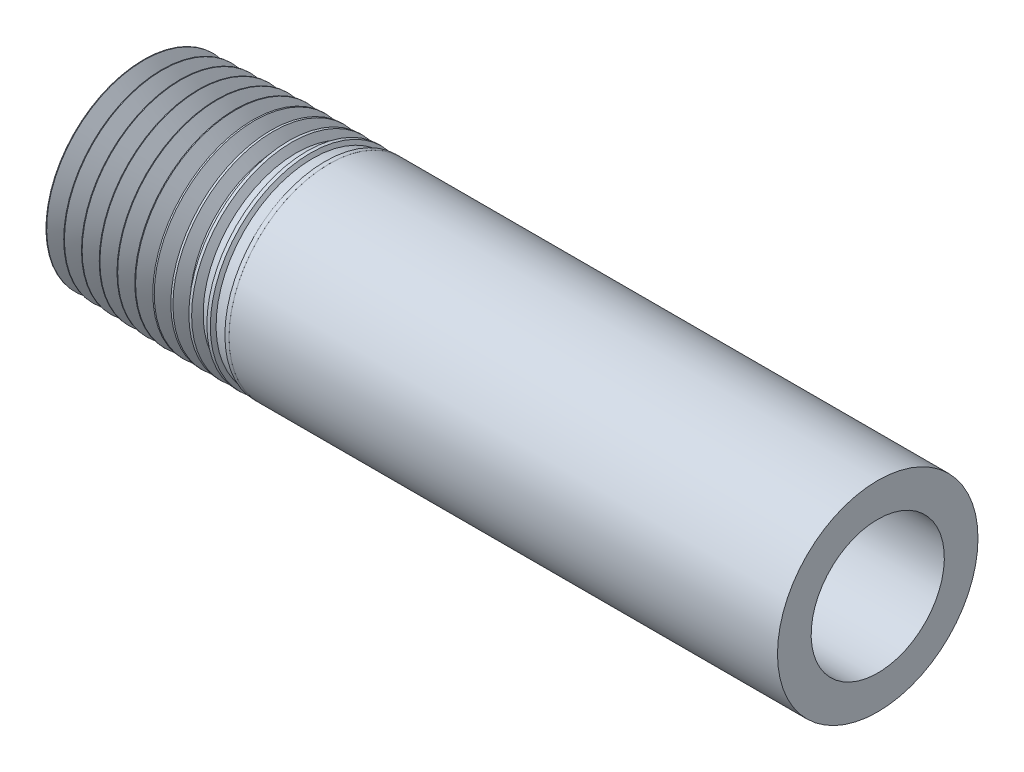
ISO-10303-21;
HEADER;
FILE_DESCRIPTION(('STEP AP214'),'2;1');
FILE_NAME('part.step','',(''),(''),'','','');
FILE_SCHEMA(('AUTOMOTIVE_DESIGN { 1 0 10303 214 1 1 1 1 }'));
ENDSEC;
DATA;
#1=APPLICATION_CONTEXT('core data for automotive mechanical design processes');
#2=APPLICATION_PROTOCOL_DEFINITION('international standard','automotive_design',2000,#1);
#3=PRODUCT_CONTEXT('',#1,'mechanical');
#4=PRODUCT('Part','Part','',(#3));
#5=PRODUCT_RELATED_PRODUCT_CATEGORY('part','',(#4));
#6=PRODUCT_DEFINITION_FORMATION('','',#4);
#7=PRODUCT_DEFINITION_CONTEXT('part definition',#1,'design');
#8=PRODUCT_DEFINITION('design','',#6,#7);
#9=PRODUCT_DEFINITION_SHAPE('','',#8);
#10=(LENGTH_UNIT() NAMED_UNIT(*) SI_UNIT(.MILLI.,.METRE.));
#11=(NAMED_UNIT(*) PLANE_ANGLE_UNIT() SI_UNIT($,.RADIAN.));
#12=(NAMED_UNIT(*) SI_UNIT($,.STERADIAN.) SOLID_ANGLE_UNIT());
#13=UNCERTAINTY_MEASURE_WITH_UNIT(LENGTH_MEASURE(1.E-05),#10,'distance_accuracy_value','');
#14=(GEOMETRIC_REPRESENTATION_CONTEXT(3) GLOBAL_UNCERTAINTY_ASSIGNED_CONTEXT((#13)) GLOBAL_UNIT_ASSIGNED_CONTEXT((#10,
#11,#12)) REPRESENTATION_CONTEXT('',''));
#15=CARTESIAN_POINT('',(0.,0.,0.));
#16=DIRECTION('',(0.,0.,1.));
#17=DIRECTION('',(1.,0.,0.));
#18=AXIS2_PLACEMENT_3D('',#15,#16,#17);
#19=CARTESIAN_POINT('',(5.12914754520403,0.,0.));
#20=DIRECTION('',(1.,0.,0.));
#21=DIRECTION('',(0.,1.,0.));
#22=AXIS2_PLACEMENT_3D('',#19,#20,#21);
#23=CONICAL_SURFACE('',#22,5.14687067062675,1.0784389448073);
#24=CARTESIAN_POINT('',(5.12733944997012,0.,0.));
#25=DIRECTION('',(1.,0.,0.));
#26=DIRECTION('',(0.,1.,0.));
#27=AXIS2_PLACEMENT_3D('',#24,#25,#26);
#28=CIRCLE('',#27,5.1435);
#29=CARTESIAN_POINT('',(5.12733944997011,5.1435,0.));
#30=VERTEX_POINT('',#29);
#31=EDGE_CURVE('E51',#30,#30,#28,.T.);
#32=ORIENTED_EDGE('',*,*,#31,.F.);
#33=EDGE_LOOP('',(#32));
#34=FACE_BOUND('',#33,.T.);
#35=CARTESIAN_POINT('',(4.71836175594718,0.,0.));
#36=DIRECTION('',(1.,0.,0.));
#37=DIRECTION('',(0.,1.,0.));
#38=AXIS2_PLACEMENT_3D('',#35,#36,#37);
#39=CIRCLE('',#38,4.38107937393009);
#40=CARTESIAN_POINT('',(4.71836175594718,4.38107937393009,0.));
#41=VERTEX_POINT('',#40);
#42=EDGE_CURVE('E146',#41,#41,#39,.T.);
#43=ORIENTED_EDGE('',*,*,#42,.T.);
#44=EDGE_LOOP('',(#43));
#45=FACE_BOUND('',#44,.T.);
#46=ADVANCED_FACE('F31',(#34,#45),#23,.T.);
#47=CARTESIAN_POINT('',(4.71836175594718,0.,0.));
#48=DIRECTION('',(1.,0.,0.));
#49=DIRECTION('',(0.,1.,0.));
#50=AXIS2_PLACEMENT_3D('',#47,#48,#49);
#51=CONICAL_SURFACE('',#50,4.38107937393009,0.0312413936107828);
#52=CARTESIAN_POINT('',(4.68251471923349,0.,0.));
#53=DIRECTION('',(1.,0.,0.));
#54=DIRECTION('',(0.,1.,0.));
#55=AXIS2_PLACEMENT_3D('',#52,#53,#54);
#56=CIRCLE('',#55,4.37995909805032);
#57=CARTESIAN_POINT('',(4.68251471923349,4.37995909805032,0.));
#58=VERTEX_POINT('',#57);
#59=EDGE_CURVE('E143',#58,#58,#56,.T.);
#60=ORIENTED_EDGE('',*,*,#59,.T.);
#61=EDGE_LOOP('',(#60));
#62=FACE_BOUND('',#61,.T.);
#63=ORIENTED_EDGE('',*,*,#42,.F.);
#64=EDGE_LOOP('',(#63));
#65=FACE_BOUND('',#64,.T.);
#66=ADVANCED_FACE('F167',(#62,#65),#51,.T.);
#67=CARTESIAN_POINT('',(4.68251471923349,0.,0.));
#68=DIRECTION('',(-1.,0.,0.));
#69=DIRECTION('',(0.,-1.,0.));
#70=AXIS2_PLACEMENT_3D('',#67,#68,#69);
#71=CONICAL_SURFACE('',#70,4.37995909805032,1.01595615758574);
#72=CARTESIAN_POINT('',(4.22471289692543,0.,0.));
#73=DIRECTION('',(1.,0.,0.));
#74=DIRECTION('',(0.,1.,0.));
#75=AXIS2_PLACEMENT_3D('',#72,#73,#74);
#76=CIRCLE('',#75,5.11860567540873);
#77=CARTESIAN_POINT('',(4.22471289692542,5.11860567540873,0.));
#78=VERTEX_POINT('',#77);
#79=EDGE_CURVE('E140',#78,#78,#76,.T.);
#80=ORIENTED_EDGE('',*,*,#79,.T.);
#81=EDGE_LOOP('',(#80));
#82=FACE_BOUND('',#81,.T.);
#83=ORIENTED_EDGE('',*,*,#59,.F.);
#84=EDGE_LOOP('',(#83));
#85=FACE_BOUND('',#84,.T.);
#86=ADVANCED_FACE('F172',(#82,#85),#71,.T.);
#87=CARTESIAN_POINT('',(4.22471289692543,0.,0.));
#88=DIRECTION('',(1.,0.,0.));
#89=DIRECTION('',(0.,1.,0.));
#90=AXIS2_PLACEMENT_3D('',#87,#88,#89);
#91=CONICAL_SURFACE('',#90,5.11860567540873,0.0312413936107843);
#92=CARTESIAN_POINT('',(4.18886586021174,0.,0.));
#93=DIRECTION('',(1.,0.,0.));
#94=DIRECTION('',(0.,1.,0.));
#95=AXIS2_PLACEMENT_3D('',#92,#93,#94);
#96=CIRCLE('',#95,5.11748539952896);
#97=CARTESIAN_POINT('',(4.18886586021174,5.11748539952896,0.));
#98=VERTEX_POINT('',#97);
#99=EDGE_CURVE('E137',#98,#98,#96,.T.);
#100=ORIENTED_EDGE('',*,*,#99,.T.);
#101=EDGE_LOOP('',(#100));
#102=FACE_BOUND('',#101,.T.);
#103=ORIENTED_EDGE('',*,*,#79,.F.);
#104=EDGE_LOOP('',(#103));
#105=FACE_BOUND('',#104,.T.);
#106=ADVANCED_FACE('F178',(#102,#105),#91,.T.);
#107=CARTESIAN_POINT('',(4.18886586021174,0.,0.));
#108=DIRECTION('',(1.,0.,0.));
#109=DIRECTION('',(0.,1.,0.));
#110=AXIS2_PLACEMENT_3D('',#107,#108,#109);
#111=CONICAL_SURFACE('',#110,5.11748539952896,1.07843894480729);
#112=CARTESIAN_POINT('',(3.77808007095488,0.,0.));
#113=DIRECTION('',(1.,0.,0.));
#114=DIRECTION('',(0.,1.,0.));
#115=AXIS2_PLACEMENT_3D('',#112,#113,#114);
#116=CIRCLE('',#115,4.3516941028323);
#117=CARTESIAN_POINT('',(3.77808007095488,4.3516941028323,0.));
#118=VERTEX_POINT('',#117);
#119=EDGE_CURVE('E134',#118,#118,#116,.T.);
#120=ORIENTED_EDGE('',*,*,#119,.T.);
#121=EDGE_LOOP('',(#120));
#122=FACE_BOUND('',#121,.T.);
#123=ORIENTED_EDGE('',*,*,#99,.F.);
#124=EDGE_LOOP('',(#123));
#125=FACE_BOUND('',#124,.T.);
#126=ADVANCED_FACE('F370',(#122,#125),#111,.T.);
#127=CARTESIAN_POINT('',(3.77808007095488,0.,0.));
#128=DIRECTION('',(1.,0.,0.));
#129=DIRECTION('',(0.,1.,0.));
#130=AXIS2_PLACEMENT_3D('',#127,#128,#129);
#131=CONICAL_SURFACE('',#130,4.3516941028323,0.0312413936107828);
#132=CARTESIAN_POINT('',(3.74223303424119,0.,0.));
#133=DIRECTION('',(1.,0.,0.));
#134=DIRECTION('',(0.,1.,0.));
#135=AXIS2_PLACEMENT_3D('',#132,#133,#134);
#136=CIRCLE('',#135,4.35057382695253);
#137=CARTESIAN_POINT('',(3.74223303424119,4.35057382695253,0.));
#138=VERTEX_POINT('',#137);
#139=EDGE_CURVE('E131',#138,#138,#136,.T.);
#140=ORIENTED_EDGE('',*,*,#139,.T.);
#141=EDGE_LOOP('',(#140));
#142=FACE_BOUND('',#141,.T.);
#143=ORIENTED_EDGE('',*,*,#119,.F.);
#144=EDGE_LOOP('',(#143));
#145=FACE_BOUND('',#144,.T.);
#146=ADVANCED_FACE('F366',(#142,#145),#131,.T.);
#147=CARTESIAN_POINT('',(3.74223303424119,0.,0.));
#148=DIRECTION('',(-1.,0.,0.));
#149=DIRECTION('',(0.,-1.,0.));
#150=AXIS2_PLACEMENT_3D('',#147,#148,#149);
#151=CONICAL_SURFACE('',#150,4.35057382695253,1.01595615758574);
#152=CARTESIAN_POINT('',(3.28443121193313,0.,0.));
#153=DIRECTION('',(1.,0.,0.));
#154=DIRECTION('',(0.,1.,0.));
#155=AXIS2_PLACEMENT_3D('',#152,#153,#154);
#156=CIRCLE('',#155,5.08922040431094);
#157=CARTESIAN_POINT('',(3.28443121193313,5.08922040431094,0.));
#158=VERTEX_POINT('',#157);
#159=EDGE_CURVE('E128',#158,#158,#156,.T.);
#160=ORIENTED_EDGE('',*,*,#159,.T.);
#161=EDGE_LOOP('',(#160));
#162=FACE_BOUND('',#161,.T.);
#163=ORIENTED_EDGE('',*,*,#139,.F.);
#164=EDGE_LOOP('',(#163));
#165=FACE_BOUND('',#164,.T.);
#166=ADVANCED_FACE('F362',(#162,#165),#151,.T.);
#167=CARTESIAN_POINT('',(3.28443121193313,0.,0.));
#168=DIRECTION('',(1.,0.,0.));
#169=DIRECTION('',(0.,1.,0.));
#170=AXIS2_PLACEMENT_3D('',#167,#168,#169);
#171=CONICAL_SURFACE('',#170,5.08922040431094,0.0312413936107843);
#172=CARTESIAN_POINT('',(3.24858417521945,0.,0.));
#173=DIRECTION('',(1.,0.,0.));
#174=DIRECTION('',(0.,1.,0.));
#175=AXIS2_PLACEMENT_3D('',#172,#173,#174);
#176=CIRCLE('',#175,5.08810012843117);
#177=CARTESIAN_POINT('',(3.24858417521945,5.08810012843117,0.));
#178=VERTEX_POINT('',#177);
#179=EDGE_CURVE('E125',#178,#178,#176,.T.);
#180=ORIENTED_EDGE('',*,*,#179,.T.);
#181=EDGE_LOOP('',(#180));
#182=FACE_BOUND('',#181,.T.);
#183=ORIENTED_EDGE('',*,*,#159,.F.);
#184=EDGE_LOOP('',(#183));
#185=FACE_BOUND('',#184,.T.);
#186=ADVANCED_FACE('F358',(#182,#185),#171,.T.);
#187=CARTESIAN_POINT('',(3.24858417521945,0.,0.));
#188=DIRECTION('',(1.,0.,0.));
#189=DIRECTION('',(0.,1.,0.));
#190=AXIS2_PLACEMENT_3D('',#187,#188,#189);
#191=CONICAL_SURFACE('',#190,5.08810012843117,1.0784389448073);
#192=CARTESIAN_POINT('',(2.83779838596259,0.,0.));
#193=DIRECTION('',(1.,0.,0.));
#194=DIRECTION('',(0.,1.,0.));
#195=AXIS2_PLACEMENT_3D('',#192,#193,#194);
#196=CIRCLE('',#195,4.32230883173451);
#197=CARTESIAN_POINT('',(2.83779838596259,4.32230883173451,0.));
#198=VERTEX_POINT('',#197);
#199=EDGE_CURVE('E122',#198,#198,#196,.T.);
#200=ORIENTED_EDGE('',*,*,#199,.T.);
#201=EDGE_LOOP('',(#200));
#202=FACE_BOUND('',#201,.T.);
#203=ORIENTED_EDGE('',*,*,#179,.F.);
#204=EDGE_LOOP('',(#203));
#205=FACE_BOUND('',#204,.T.);
#206=ADVANCED_FACE('F354',(#202,#205),#191,.T.);
#207=CARTESIAN_POINT('',(2.83779838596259,0.,0.));
#208=DIRECTION('',(1.,0.,0.));
#209=DIRECTION('',(0.,1.,0.));
#210=AXIS2_PLACEMENT_3D('',#207,#208,#209);
#211=CONICAL_SURFACE('',#210,4.32230883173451,0.0312413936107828);
#212=CARTESIAN_POINT('',(2.8019513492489,0.,0.));
#213=DIRECTION('',(1.,0.,0.));
#214=DIRECTION('',(0.,1.,0.));
#215=AXIS2_PLACEMENT_3D('',#212,#213,#214);
#216=CIRCLE('',#215,4.32118855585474);
#217=CARTESIAN_POINT('',(2.8019513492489,4.32118855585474,0.));
#218=VERTEX_POINT('',#217);
#219=EDGE_CURVE('E119',#218,#218,#216,.T.);
#220=ORIENTED_EDGE('',*,*,#219,.T.);
#221=EDGE_LOOP('',(#220));
#222=FACE_BOUND('',#221,.T.);
#223=ORIENTED_EDGE('',*,*,#199,.F.);
#224=EDGE_LOOP('',(#223));
#225=FACE_BOUND('',#224,.T.);
#226=ADVANCED_FACE('F350',(#222,#225),#211,.T.);
#227=CARTESIAN_POINT('',(2.8019513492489,0.,0.));
#228=DIRECTION('',(-1.,0.,0.));
#229=DIRECTION('',(0.,-1.,0.));
#230=AXIS2_PLACEMENT_3D('',#227,#228,#229);
#231=CONICAL_SURFACE('',#230,4.32118855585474,1.01595615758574);
#232=CARTESIAN_POINT('',(2.34414952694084,0.,0.));
#233=DIRECTION('',(1.,0.,0.));
#234=DIRECTION('',(0.,1.,0.));
#235=AXIS2_PLACEMENT_3D('',#232,#233,#234);
#236=CIRCLE('',#235,5.05983513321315);
#237=CARTESIAN_POINT('',(2.34414952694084,5.05983513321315,0.));
#238=VERTEX_POINT('',#237);
#239=EDGE_CURVE('E116',#238,#238,#236,.T.);
#240=ORIENTED_EDGE('',*,*,#239,.T.);
#241=EDGE_LOOP('',(#240));
#242=FACE_BOUND('',#241,.T.);
#243=ORIENTED_EDGE('',*,*,#219,.F.);
#244=EDGE_LOOP('',(#243));
#245=FACE_BOUND('',#244,.T.);
#246=ADVANCED_FACE('F346',(#242,#245),#231,.T.);
#247=CARTESIAN_POINT('',(2.34414952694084,0.,0.));
#248=DIRECTION('',(1.,0.,0.));
#249=DIRECTION('',(0.,1.,0.));
#250=AXIS2_PLACEMENT_3D('',#247,#248,#249);
#251=CONICAL_SURFACE('',#250,5.05983513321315,0.0312413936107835);
#252=CARTESIAN_POINT('',(2.30830249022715,0.,0.));
#253=DIRECTION('',(1.,0.,0.));
#254=DIRECTION('',(0.,1.,0.));
#255=AXIS2_PLACEMENT_3D('',#252,#253,#254);
#256=CIRCLE('',#255,5.05871485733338);
#257=CARTESIAN_POINT('',(2.30830249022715,5.05871485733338,0.));
#258=VERTEX_POINT('',#257);
#259=EDGE_CURVE('E113',#258,#258,#256,.T.);
#260=ORIENTED_EDGE('',*,*,#259,.T.);
#261=EDGE_LOOP('',(#260));
#262=FACE_BOUND('',#261,.T.);
#263=ORIENTED_EDGE('',*,*,#239,.F.);
#264=EDGE_LOOP('',(#263));
#265=FACE_BOUND('',#264,.T.);
#266=ADVANCED_FACE('F342',(#262,#265),#251,.T.);
#267=CARTESIAN_POINT('',(2.30830249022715,0.,0.));
#268=DIRECTION('',(1.,0.,0.));
#269=DIRECTION('',(0.,1.,0.));
#270=AXIS2_PLACEMENT_3D('',#267,#268,#269);
#271=CONICAL_SURFACE('',#270,5.05871485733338,1.0784389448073);
#272=CARTESIAN_POINT('',(1.8975167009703,0.,0.));
#273=DIRECTION('',(1.,0.,0.));
#274=DIRECTION('',(0.,1.,0.));
#275=AXIS2_PLACEMENT_3D('',#272,#273,#274);
#276=CIRCLE('',#275,4.29292356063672);
#277=CARTESIAN_POINT('',(1.89751670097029,4.29292356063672,0.));
#278=VERTEX_POINT('',#277);
#279=EDGE_CURVE('E110',#278,#278,#276,.T.);
#280=ORIENTED_EDGE('',*,*,#279,.T.);
#281=EDGE_LOOP('',(#280));
#282=FACE_BOUND('',#281,.T.);
#283=ORIENTED_EDGE('',*,*,#259,.F.);
#284=EDGE_LOOP('',(#283));
#285=FACE_BOUND('',#284,.T.);
#286=ADVANCED_FACE('F338',(#282,#285),#271,.T.);
#287=CARTESIAN_POINT('',(1.8975167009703,0.,0.));
#288=DIRECTION('',(1.,0.,0.));
#289=DIRECTION('',(0.,1.,0.));
#290=AXIS2_PLACEMENT_3D('',#287,#288,#289);
#291=CONICAL_SURFACE('',#290,4.29292356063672,0.0312413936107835);
#292=CARTESIAN_POINT('',(1.86166966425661,0.,0.));
#293=DIRECTION('',(1.,0.,0.));
#294=DIRECTION('',(0.,1.,0.));
#295=AXIS2_PLACEMENT_3D('',#292,#293,#294);
#296=CIRCLE('',#295,4.29180328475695);
#297=CARTESIAN_POINT('',(1.86166966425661,4.29180328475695,0.));
#298=VERTEX_POINT('',#297);
#299=EDGE_CURVE('E107',#298,#298,#296,.T.);
#300=ORIENTED_EDGE('',*,*,#299,.T.);
#301=EDGE_LOOP('',(#300));
#302=FACE_BOUND('',#301,.T.);
#303=ORIENTED_EDGE('',*,*,#279,.F.);
#304=EDGE_LOOP('',(#303));
#305=FACE_BOUND('',#304,.T.);
#306=ADVANCED_FACE('F334',(#302,#305),#291,.T.);
#307=CARTESIAN_POINT('',(1.86166966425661,0.,0.));
#308=DIRECTION('',(-1.,0.,0.));
#309=DIRECTION('',(0.,-1.,0.));
#310=AXIS2_PLACEMENT_3D('',#307,#308,#309);
#311=CONICAL_SURFACE('',#310,4.29180328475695,1.01595615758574);
#312=CARTESIAN_POINT('',(1.40386784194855,0.,0.));
#313=DIRECTION('',(1.,0.,0.));
#314=DIRECTION('',(0.,1.,0.));
#315=AXIS2_PLACEMENT_3D('',#312,#313,#314);
#316=CIRCLE('',#315,5.03044986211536);
#317=CARTESIAN_POINT('',(1.40386784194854,5.03044986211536,0.));
#318=VERTEX_POINT('',#317);
#319=EDGE_CURVE('E104',#318,#318,#316,.T.);
#320=ORIENTED_EDGE('',*,*,#319,.T.);
#321=EDGE_LOOP('',(#320));
#322=FACE_BOUND('',#321,.T.);
#323=ORIENTED_EDGE('',*,*,#299,.F.);
#324=EDGE_LOOP('',(#323));
#325=FACE_BOUND('',#324,.T.);
#326=ADVANCED_FACE('F330',(#322,#325),#311,.T.);
#327=CARTESIAN_POINT('',(1.40386784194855,0.,0.));
#328=DIRECTION('',(1.,0.,0.));
#329=DIRECTION('',(0.,1.,0.));
#330=AXIS2_PLACEMENT_3D('',#327,#328,#329);
#331=CONICAL_SURFACE('',#330,5.03044986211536,0.0312413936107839);
#332=CARTESIAN_POINT('',(1.36802080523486,0.,0.));
#333=DIRECTION('',(1.,0.,0.));
#334=DIRECTION('',(0.,1.,0.));
#335=AXIS2_PLACEMENT_3D('',#332,#333,#334);
#336=CIRCLE('',#335,5.02932958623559);
#337=CARTESIAN_POINT('',(1.36802080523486,5.02932958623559,0.));
#338=VERTEX_POINT('',#337);
#339=EDGE_CURVE('E101',#338,#338,#336,.T.);
#340=ORIENTED_EDGE('',*,*,#339,.T.);
#341=EDGE_LOOP('',(#340));
#342=FACE_BOUND('',#341,.T.);
#343=ORIENTED_EDGE('',*,*,#319,.F.);
#344=EDGE_LOOP('',(#343));
#345=FACE_BOUND('',#344,.T.);
#346=ADVANCED_FACE('F326',(#342,#345),#331,.T.);
#347=CARTESIAN_POINT('',(1.36802080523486,0.,0.));
#348=DIRECTION('',(1.,0.,0.));
#349=DIRECTION('',(0.,1.,0.));
#350=AXIS2_PLACEMENT_3D('',#347,#348,#349);
#351=CONICAL_SURFACE('',#350,5.02932958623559,1.0784389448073);
#352=CARTESIAN_POINT('',(0.957235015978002,0.,0.));
#353=DIRECTION('',(1.,0.,0.));
#354=DIRECTION('',(0.,1.,0.));
#355=AXIS2_PLACEMENT_3D('',#352,#353,#354);
#356=CIRCLE('',#355,4.26353828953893);
#357=CARTESIAN_POINT('',(0.957235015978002,4.26353828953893,0.));
#358=VERTEX_POINT('',#357);
#359=EDGE_CURVE('E98',#358,#358,#356,.T.);
#360=ORIENTED_EDGE('',*,*,#359,.T.);
#361=EDGE_LOOP('',(#360));
#362=FACE_BOUND('',#361,.T.);
#363=ORIENTED_EDGE('',*,*,#339,.F.);
#364=EDGE_LOOP('',(#363));
#365=FACE_BOUND('',#364,.T.);
#366=ADVANCED_FACE('F322',(#362,#365),#351,.T.);
#367=CARTESIAN_POINT('',(0.957235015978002,0.,0.));
#368=DIRECTION('',(1.,0.,0.));
#369=DIRECTION('',(0.,1.,0.));
#370=AXIS2_PLACEMENT_3D('',#367,#368,#369);
#371=CONICAL_SURFACE('',#370,4.26353828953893,0.0312413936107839);
#372=CARTESIAN_POINT('',(0.921387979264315,0.,0.));
#373=DIRECTION('',(1.,0.,0.));
#374=DIRECTION('',(0.,1.,0.));
#375=AXIS2_PLACEMENT_3D('',#372,#373,#374);
#376=CIRCLE('',#375,4.26241801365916);
#377=CARTESIAN_POINT('',(0.921387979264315,4.26241801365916,0.));
#378=VERTEX_POINT('',#377);
#379=EDGE_CURVE('E95',#378,#378,#376,.T.);
#380=ORIENTED_EDGE('',*,*,#379,.T.);
#381=EDGE_LOOP('',(#380));
#382=FACE_BOUND('',#381,.T.);
#383=ORIENTED_EDGE('',*,*,#359,.F.);
#384=EDGE_LOOP('',(#383));
#385=FACE_BOUND('',#384,.T.);
#386=ADVANCED_FACE('F318',(#382,#385),#371,.T.);
#387=CARTESIAN_POINT('',(0.921387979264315,0.,0.));
#388=DIRECTION('',(-1.,0.,0.));
#389=DIRECTION('',(0.,-1.,0.));
#390=AXIS2_PLACEMENT_3D('',#387,#388,#389);
#391=CONICAL_SURFACE('',#390,4.26241801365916,1.01595615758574);
#392=CARTESIAN_POINT('',(0.463586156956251,0.,0.));
#393=DIRECTION('',(1.,0.,0.));
#394=DIRECTION('',(0.,1.,0.));
#395=AXIS2_PLACEMENT_3D('',#392,#393,#394);
#396=CIRCLE('',#395,5.00106459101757);
#397=CARTESIAN_POINT('',(0.463586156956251,5.00106459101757,0.));
#398=VERTEX_POINT('',#397);
#399=EDGE_CURVE('E92',#398,#398,#396,.T.);
#400=ORIENTED_EDGE('',*,*,#399,.T.);
#401=EDGE_LOOP('',(#400));
#402=FACE_BOUND('',#401,.T.);
#403=ORIENTED_EDGE('',*,*,#379,.F.);
#404=EDGE_LOOP('',(#403));
#405=FACE_BOUND('',#404,.T.);
#406=ADVANCED_FACE('F314',(#402,#405),#391,.T.);
#407=CARTESIAN_POINT('',(0.463586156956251,0.,0.));
#408=DIRECTION('',(1.,0.,0.));
#409=DIRECTION('',(0.,1.,0.));
#410=AXIS2_PLACEMENT_3D('',#407,#408,#409);
#411=CONICAL_SURFACE('',#410,5.00106459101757,0.0312413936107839);
#412=CARTESIAN_POINT('',(0.427739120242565,0.,0.));
#413=DIRECTION('',(1.,0.,0.));
#414=DIRECTION('',(0.,1.,0.));
#415=AXIS2_PLACEMENT_3D('',#412,#413,#414);
#416=CIRCLE('',#415,4.9999443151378);
#417=CARTESIAN_POINT('',(0.427739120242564,4.9999443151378,0.));
#418=VERTEX_POINT('',#417);
#419=EDGE_CURVE('E89',#418,#418,#416,.T.);
#420=ORIENTED_EDGE('',*,*,#419,.T.);
#421=EDGE_LOOP('',(#420));
#422=FACE_BOUND('',#421,.T.);
#423=ORIENTED_EDGE('',*,*,#399,.F.);
#424=EDGE_LOOP('',(#423));
#425=FACE_BOUND('',#424,.T.);
#426=ADVANCED_FACE('F307',(#422,#425),#411,.T.);
#427=CARTESIAN_POINT('',(0.0169533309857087,0.,0.));
#428=DIRECTION('',(1.,0.,0.));
#429=DIRECTION('',(0.,1.,0.));
#430=AXIS2_PLACEMENT_3D('',#427,#428,#429);
#431=CONICAL_SURFACE('',#430,4.23415301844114,1.07843894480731);
#432=CARTESIAN_POINT('',(0.,0.,0.));
#433=DIRECTION('',(1.,0.,0.));
#434=DIRECTION('',(0.,1.,0.));
#435=AXIS2_PLACEMENT_3D('',#432,#433,#434);
#436=CIRCLE('',#435,4.20254843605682);
#437=CARTESIAN_POINT('',(0.,4.20254843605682,0.));
#438=VERTEX_POINT('',#437);
#439=EDGE_CURVE('E86',#438,#438,#436,.T.);
#440=ORIENTED_EDGE('',*,*,#439,.T.);
#441=EDGE_LOOP('',(#440));
#442=FACE_BOUND('',#441,.T.);
#443=ORIENTED_EDGE('',*,*,#419,.F.);
#444=EDGE_LOOP('',(#443));
#445=FACE_BOUND('',#444,.T.);
#446=ADVANCED_FACE('F296',(#442,#445),#431,.T.);
#447=CARTESIAN_POINT('',(0.,0.,0.));
#448=DIRECTION('',(-1.,0.,0.));
#449=DIRECTION('',(0.,-1.,0.));
#450=AXIS2_PLACEMENT_3D('',#447,#448,#449);
#451=PLANE('',#450);
#452=CARTESIAN_POINT('',(0.,0.,0.));
#453=DIRECTION('',(1.,0.,0.));
#454=DIRECTION('',(0.,1.,0.));
#455=AXIS2_PLACEMENT_3D('',#452,#453,#454);
#456=CIRCLE('',#455,3.4163);
#457=CARTESIAN_POINT('',(0.,3.4163,0.));
#458=VERTEX_POINT('',#457);
#459=EDGE_CURVE('E48',#458,#458,#456,.T.);
#460=ORIENTED_EDGE('',*,*,#459,.T.);
#461=EDGE_LOOP('',(#460));
#462=FACE_BOUND('',#461,.T.);
#463=ORIENTED_EDGE('',*,*,#439,.F.);
#464=EDGE_LOOP('',(#463));
#465=FACE_BOUND('',#464,.T.);
#466=ADVANCED_FACE('F291',(#462,#465),#451,.T.);
#467=CARTESIAN_POINT('',(0.,0.,0.));
#468=DIRECTION('',(1.,0.,0.));
#469=DIRECTION('',(0.,1.,0.));
#470=AXIS2_PLACEMENT_3D('',#467,#468,#469);
#471=CYLINDRICAL_SURFACE('',#470,5.1435);
#472=CARTESIAN_POINT('',(5.1677780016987,0.,0.));
#473=DIRECTION('',(-1.,0.,0.));
#474=DIRECTION('',(0.,-1.,0.));
#475=AXIS2_PLACEMENT_3D('',#472,#473,#474);
#476=CIRCLE('',#475,5.1435);
#477=CARTESIAN_POINT('',(5.1677780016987,-5.1435,0.));
#478=VERTEX_POINT('',#477);
#479=EDGE_CURVE('E53',#478,#478,#476,.T.);
#480=ORIENTED_EDGE('',*,*,#479,.T.);
#481=EDGE_LOOP('',(#480));
#482=FACE_BOUND('',#481,.T.);
#483=ORIENTED_EDGE('',*,*,#31,.T.);
#484=EDGE_LOOP('',(#483));
#485=FACE_BOUND('',#484,.T.);
#486=ADVANCED_FACE('F163',(#482,#485),#471,.T.);
#487=CARTESIAN_POINT('',(6.06942923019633,0.,0.));
#488=DIRECTION('',(1.,0.,0.));
#489=DIRECTION('',(0.,1.,0.));
#490=AXIS2_PLACEMENT_3D('',#487,#488,#489);
#491=CONICAL_SURFACE('',#490,5.17625594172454,1.0784389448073);
#492=CARTESIAN_POINT('',(6.05185828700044,0.,0.));
#493=DIRECTION('',(1.,0.,0.));
#494=DIRECTION('',(0.,1.,0.));
#495=AXIS2_PLACEMENT_3D('',#492,#493,#494);
#496=CIRCLE('',#495,5.1435);
#497=CARTESIAN_POINT('',(6.05185828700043,5.1435,0.));
#498=VERTEX_POINT('',#497);
#499=EDGE_CURVE('E56',#498,#498,#496,.T.);
#500=ORIENTED_EDGE('',*,*,#499,.F.);
#501=EDGE_LOOP('',(#500));
#502=FACE_BOUND('',#501,.T.);
#503=CARTESIAN_POINT('',(5.65864344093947,0.,0.));
#504=DIRECTION('',(1.,0.,0.));
#505=DIRECTION('',(0.,1.,0.));
#506=AXIS2_PLACEMENT_3D('',#503,#504,#505);
#507=CIRCLE('',#506,4.41046464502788);
#508=CARTESIAN_POINT('',(5.65864344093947,4.41046464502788,0.));
#509=VERTEX_POINT('',#508);
#510=EDGE_CURVE('E152',#509,#509,#507,.T.);
#511=ORIENTED_EDGE('',*,*,#510,.T.);
#512=EDGE_LOOP('',(#511));
#513=FACE_BOUND('',#512,.T.);
#514=ADVANCED_FACE('F191',(#502,#513),#491,.T.);
#515=CARTESIAN_POINT('',(5.65864344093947,0.,0.));
#516=DIRECTION('',(1.,0.,0.));
#517=DIRECTION('',(0.,1.,0.));
#518=AXIS2_PLACEMENT_3D('',#515,#516,#517);
#519=CONICAL_SURFACE('',#518,4.41046464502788,0.0312413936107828);
#520=CARTESIAN_POINT('',(5.62279640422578,0.,0.));
#521=DIRECTION('',(1.,0.,0.));
#522=DIRECTION('',(0.,1.,0.));
#523=AXIS2_PLACEMENT_3D('',#520,#521,#522);
#524=CIRCLE('',#523,4.40934436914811);
#525=CARTESIAN_POINT('',(5.62279640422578,4.40934436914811,0.));
#526=VERTEX_POINT('',#525);
#527=EDGE_CURVE('E149',#526,#526,#524,.T.);
#528=ORIENTED_EDGE('',*,*,#527,.T.);
#529=EDGE_LOOP('',(#528));
#530=FACE_BOUND('',#529,.T.);
#531=ORIENTED_EDGE('',*,*,#510,.F.);
#532=EDGE_LOOP('',(#531));
#533=FACE_BOUND('',#532,.T.);
#534=ADVANCED_FACE('F187',(#530,#533),#519,.T.);
#535=CARTESIAN_POINT('',(5.62279640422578,0.,0.));
#536=DIRECTION('',(-1.,0.,0.));
#537=DIRECTION('',(0.,-1.,0.));
#538=AXIS2_PLACEMENT_3D('',#535,#536,#537);
#539=CONICAL_SURFACE('',#538,4.40934436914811,1.01595615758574);
#540=ORIENTED_EDGE('',*,*,#479,.F.);
#541=EDGE_LOOP('',(#540));
#542=FACE_BOUND('',#541,.T.);
#543=ORIENTED_EDGE('',*,*,#527,.F.);
#544=EDGE_LOOP('',(#543));
#545=FACE_BOUND('',#544,.T.);
#546=ADVANCED_FACE('F183',(#542,#545),#539,.T.);
#547=CARTESIAN_POINT('',(6.12627222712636,0.,0.));
#548=DIRECTION('',(-1.,0.,0.));
#549=DIRECTION('',(0.,-1.,0.));
#550=AXIS2_PLACEMENT_3D('',#547,#548,#549);
#551=CIRCLE('',#550,5.1435);
#552=CARTESIAN_POINT('',(6.12627222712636,-5.1435,0.));
#553=VERTEX_POINT('',#552);
#554=EDGE_CURVE('E59',#553,#553,#551,.T.);
#555=ORIENTED_EDGE('',*,*,#554,.T.);
#556=EDGE_LOOP('',(#555));
#557=FACE_BOUND('',#556,.T.);
#558=ORIENTED_EDGE('',*,*,#499,.T.);
#559=EDGE_LOOP('',(#558));
#560=FACE_BOUND('',#559,.T.);
#561=ADVANCED_FACE('F186',(#557,#560),#471,.T.);
#562=CARTESIAN_POINT('',(7.00971091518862,0.,0.));
#563=DIRECTION('',(1.,0.,0.));
#564=DIRECTION('',(0.,1.,0.));
#565=AXIS2_PLACEMENT_3D('',#562,#563,#564);
#566=CONICAL_SURFACE('',#565,5.20564121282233,1.07843894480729);
#567=CARTESIAN_POINT('',(6.97637712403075,0.,0.));
#568=DIRECTION('',(1.,0.,0.));
#569=DIRECTION('',(0.,1.,0.));
#570=AXIS2_PLACEMENT_3D('',#567,#568,#569);
#571=CIRCLE('',#570,5.1435);
#572=CARTESIAN_POINT('',(6.97637712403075,5.1435,0.));
#573=VERTEX_POINT('',#572);
#574=EDGE_CURVE('E62',#573,#573,#571,.T.);
#575=ORIENTED_EDGE('',*,*,#574,.F.);
#576=EDGE_LOOP('',(#575));
#577=FACE_BOUND('',#576,.T.);
#578=CARTESIAN_POINT('',(6.59892512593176,0.,0.));
#579=DIRECTION('',(1.,0.,0.));
#580=DIRECTION('',(0.,1.,0.));
#581=AXIS2_PLACEMENT_3D('',#578,#579,#580);
#582=CIRCLE('',#581,4.43984991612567);
#583=CARTESIAN_POINT('',(6.59892512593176,4.43984991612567,0.));
#584=VERTEX_POINT('',#583);
#585=EDGE_CURVE('E158',#584,#584,#582,.T.);
#586=ORIENTED_EDGE('',*,*,#585,.T.);
#587=EDGE_LOOP('',(#586));
#588=FACE_BOUND('',#587,.T.);
#589=ADVANCED_FACE('F204',(#577,#588),#566,.T.);
#590=CARTESIAN_POINT('',(6.59892512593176,0.,0.));
#591=DIRECTION('',(1.,0.,0.));
#592=DIRECTION('',(0.,1.,0.));
#593=AXIS2_PLACEMENT_3D('',#590,#591,#592);
#594=CONICAL_SURFACE('',#593,4.43984991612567,0.0312413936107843);
#595=CARTESIAN_POINT('',(6.56307808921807,0.,0.));
#596=DIRECTION('',(1.,0.,0.));
#597=DIRECTION('',(0.,1.,0.));
#598=AXIS2_PLACEMENT_3D('',#595,#596,#597);
#599=CIRCLE('',#598,4.4387296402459);
#600=CARTESIAN_POINT('',(6.56307808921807,4.4387296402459,0.));
#601=VERTEX_POINT('',#600);
#602=EDGE_CURVE('E155',#601,#601,#599,.T.);
#603=ORIENTED_EDGE('',*,*,#602,.T.);
#604=EDGE_LOOP('',(#603));
#605=FACE_BOUND('',#604,.T.);
#606=ORIENTED_EDGE('',*,*,#585,.F.);
#607=EDGE_LOOP('',(#606));
#608=FACE_BOUND('',#607,.T.);
#609=ADVANCED_FACE('F200',(#605,#608),#594,.T.);
#610=CARTESIAN_POINT('',(6.56307808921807,0.,0.));
#611=DIRECTION('',(-1.,0.,0.));
#612=DIRECTION('',(0.,-1.,0.));
#613=AXIS2_PLACEMENT_3D('',#610,#611,#612);
#614=CONICAL_SURFACE('',#613,4.4387296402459,1.01595615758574);
#615=ORIENTED_EDGE('',*,*,#554,.F.);
#616=EDGE_LOOP('',(#615));
#617=FACE_BOUND('',#616,.T.);
#618=ORIENTED_EDGE('',*,*,#602,.F.);
#619=EDGE_LOOP('',(#618));
#620=FACE_BOUND('',#619,.T.);
#621=ADVANCED_FACE('F196',(#617,#620),#614,.T.);
#622=CARTESIAN_POINT('',(7.08476645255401,0.,0.));
#623=DIRECTION('',(-1.,0.,0.));
#624=DIRECTION('',(0.,-1.,0.));
#625=AXIS2_PLACEMENT_3D('',#622,#623,#624);
#626=CIRCLE('',#625,5.1435);
#627=CARTESIAN_POINT('',(7.08476645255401,-5.1435,0.));
#628=VERTEX_POINT('',#627);
#629=EDGE_CURVE('E65',#628,#628,#626,.T.);
#630=ORIENTED_EDGE('',*,*,#629,.T.);
#631=EDGE_LOOP('',(#630));
#632=FACE_BOUND('',#631,.T.);
#633=ORIENTED_EDGE('',*,*,#574,.T.);
#634=EDGE_LOOP('',(#633));
#635=FACE_BOUND('',#634,.T.);
#636=ADVANCED_FACE('F199',(#632,#635),#471,.T.);
#637=CARTESIAN_POINT('',(7.50335977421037,0.,0.));
#638=DIRECTION('',(-1.,0.,0.));
#639=DIRECTION('',(0.,-1.,0.));
#640=AXIS2_PLACEMENT_3D('',#637,#638,#639);
#641=CONICAL_SURFACE('',#640,4.46811491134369,1.01595615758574);
#642=CARTESIAN_POINT('',(7.42329565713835,0.,0.));
#643=DIRECTION('',(1.,0.,0.));
#644=DIRECTION('',(0.,1.,0.));
#645=AXIS2_PLACEMENT_3D('',#642,#643,#644);
#646=CIRCLE('',#645,4.59729545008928);
#647=CARTESIAN_POINT('',(7.42329565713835,4.59729545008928,0.));
#648=VERTEX_POINT('',#647);
#649=EDGE_CURVE('E39',#648,#648,#646,.T.);
#650=ORIENTED_EDGE('',*,*,#649,.F.);
#651=EDGE_LOOP('',(#650));
#652=FACE_BOUND('',#651,.T.);
#653=ORIENTED_EDGE('',*,*,#629,.F.);
#654=EDGE_LOOP('',(#653));
#655=FACE_BOUND('',#654,.T.);
#656=ADVANCED_FACE('F209',(#652,#655),#641,.T.);
#657=CARTESIAN_POINT('',(0.,0.,0.));
#658=DIRECTION('',(1.,0.,0.));
#659=DIRECTION('',(0.,1.,0.));
#660=AXIS2_PLACEMENT_3D('',#657,#658,#659);
#661=CYLINDRICAL_SURFACE('',#660,3.4163);
#662=ORIENTED_EDGE('',*,*,#459,.F.);
#663=EDGE_LOOP('',(#662));
#664=FACE_BOUND('',#663,.T.);
#665=CARTESIAN_POINT('',(38.1,0.,0.));
#666=DIRECTION('',(1.,0.,0.));
#667=DIRECTION('',(0.,1.,0.));
#668=AXIS2_PLACEMENT_3D('',#665,#666,#667);
#669=CIRCLE('',#668,3.4163);
#670=CARTESIAN_POINT('',(38.1,3.4163,0.));
#671=VERTEX_POINT('',#670);
#672=EDGE_CURVE('E627',#671,#671,#669,.T.);
#673=ORIENTED_EDGE('',*,*,#672,.T.);
#674=EDGE_LOOP('',(#673));
#675=FACE_BOUND('',#674,.T.);
#676=ADVANCED_FACE('F212',(#664,#675),#661,.F.);
#677=CARTESIAN_POINT('',(9.96696000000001,0.,0.));
#678=DIRECTION('',(1.,0.,0.));
#679=DIRECTION('',(0.,1.,0.));
#680=AXIS2_PLACEMENT_3D('',#677,#678,#679);
#681=CONICAL_SURFACE('',#680,5.1435,0.211519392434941);
#682=CARTESIAN_POINT('',(9.9610373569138,0.,0.));
#683=DIRECTION('',(1.,0.,0.));
#684=DIRECTION('',(0.,1.,0.));
#685=AXIS2_PLACEMENT_3D('',#682,#683,#684);
#686=CIRCLE('',#685,5.14222822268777);
#687=CARTESIAN_POINT('',(9.9610373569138,5.14222822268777,0.));
#688=VERTEX_POINT('',#687);
#689=EDGE_CURVE('E35',#688,#688,#686,.T.);
#690=ORIENTED_EDGE('',*,*,#689,.T.);
#691=EDGE_LOOP('',(#690));
#692=FACE_BOUND('',#691,.T.);
#693=CARTESIAN_POINT('',(9.96696000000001,0.,0.));
#694=DIRECTION('',(1.,0.,0.));
#695=DIRECTION('',(0.,1.,0.));
#696=AXIS2_PLACEMENT_3D('',#693,#694,#695);
#697=CIRCLE('',#696,5.1435);
#698=CARTESIAN_POINT('',(9.96696000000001,-5.1435,0.));
#699=VERTEX_POINT('',#698);
#700=EDGE_CURVE('E52',#699,#699,#697,.T.);
#701=ORIENTED_EDGE('',*,*,#700,.F.);
#702=EDGE_LOOP('',(#701));
#703=FACE_BOUND('',#702,.T.);
#704=ADVANCED_FACE('F237',(#692,#703),#681,.T.);
#705=CARTESIAN_POINT('',(9.8305559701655,0.,0.));
#706=DIRECTION('',(1.,0.,0.));
#707=DIRECTION('',(0.,1.,0.));
#708=AXIS2_PLACEMENT_3D('',#705,#706,#707);
#709=CONICAL_SURFACE('',#708,5.2937970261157,1.07843894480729);
#710=CARTESIAN_POINT('',(9.72168086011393,0.,0.));
#711=DIRECTION('',(-1.,0.,0.));
#712=DIRECTION('',(0.,-1.,0.));
#713=AXIS2_PLACEMENT_3D('',#710,#711,#712);
#714=CIRCLE('',#713,5.09083087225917);
#715=CARTESIAN_POINT('',(9.72168086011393,-5.09083087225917,0.));
#716=VERTEX_POINT('',#715);
#717=EDGE_CURVE('E250',#716,#716,#714,.T.);
#718=ORIENTED_EDGE('',*,*,#717,.F.);
#719=EDGE_LOOP('',(#718));
#720=FACE_BOUND('',#719,.T.);
#721=CARTESIAN_POINT('',(9.74993363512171,0.,0.));
#722=DIRECTION('',(1.,0.,0.));
#723=DIRECTION('',(0.,1.,0.));
#724=AXIS2_PLACEMENT_3D('',#721,#722,#723);
#725=CIRCLE('',#724,5.1435);
#726=CARTESIAN_POINT('',(9.74993363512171,5.1435,0.));
#727=VERTEX_POINT('',#726);
#728=EDGE_CURVE('E80',#727,#727,#725,.T.);
#729=ORIENTED_EDGE('',*,*,#728,.F.);
#730=EDGE_LOOP('',(#729));
#731=FACE_BOUND('',#730,.T.);
#732=ADVANCED_FACE('F234',(#720,#731),#709,.T.);
#733=CARTESIAN_POINT('',(9.96024912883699,0.,0.));
#734=DIRECTION('',(-1.,0.,0.));
#735=DIRECTION('',(0.,-1.,0.));
#736=AXIS2_PLACEMENT_3D('',#733,#734,#735);
#737=CIRCLE('',#736,5.1435);
#738=CARTESIAN_POINT('',(9.96024912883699,-5.1435,0.));
#739=VERTEX_POINT('',#738);
#740=EDGE_CURVE('E83',#739,#739,#737,.T.);
#741=ORIENTED_EDGE('',*,*,#740,.T.);
#742=EDGE_LOOP('',(#741));
#743=FACE_BOUND('',#742,.T.);
#744=ORIENTED_EDGE('',*,*,#728,.T.);
#745=EDGE_LOOP('',(#744));
#746=FACE_BOUND('',#745,.T.);
#747=ADVANCED_FACE('F236',(#743,#746),#471,.T.);
#748=CARTESIAN_POINT('',(10.3242048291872,0.,0.));
#749=DIRECTION('',(-1.,0.,0.));
#750=DIRECTION('',(0.,-1.,0.));
#751=AXIS2_PLACEMENT_3D('',#748,#749,#750);
#752=CONICAL_SURFACE('',#751,4.55627072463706,1.01595615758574);
#753=ORIENTED_EDGE('',*,*,#689,.F.);
#754=EDGE_LOOP('',(#753));
#755=FACE_BOUND('',#754,.T.);
#756=ORIENTED_EDGE('',*,*,#740,.F.);
#757=EDGE_LOOP('',(#756));
#758=FACE_BOUND('',#757,.T.);
#759=ADVANCED_FACE('F33',(#755,#758),#752,.T.);
#760=ORIENTED_EDGE('',*,*,#717,.T.);
#761=EDGE_LOOP('',(#760));
#762=FACE_BOUND('',#761,.T.);
#763=CARTESIAN_POINT('',(9.11512345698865,0.,0.));
#764=DIRECTION('',(1.,0.,0.));
#765=DIRECTION('',(0.,1.,0.));
#766=AXIS2_PLACEMENT_3D('',#763,#764,#765);
#767=CIRCLE('',#766,4.96058396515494);
#768=CARTESIAN_POINT('',(9.11512345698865,4.96058396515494,0.));
#769=VERTEX_POINT('',#768);
#770=EDGE_CURVE('E255',#769,#769,#767,.T.);
#771=ORIENTED_EDGE('',*,*,#770,.T.);
#772=EDGE_LOOP('',(#771));
#773=FACE_BOUND('',#772,.T.);
#774=ADVANCED_FACE('F229',(#762,#773),#681,.T.);
#775=CARTESIAN_POINT('',(8.8902742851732,0.,0.));
#776=DIRECTION('',(1.,0.,0.));
#777=DIRECTION('',(0.,1.,0.));
#778=AXIS2_PLACEMENT_3D('',#775,#776,#777);
#779=CONICAL_SURFACE('',#778,5.26441175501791,1.07843894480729);
#780=CARTESIAN_POINT('',(8.67680695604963,0.,0.));
#781=DIRECTION('',(-1.,0.,0.));
#782=DIRECTION('',(0.,-1.,0.));
#783=AXIS2_PLACEMENT_3D('',#780,#781,#782);
#784=CIRCLE('',#783,4.86646365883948);
#785=CARTESIAN_POINT('',(8.67680695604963,-4.86646365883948,0.));
#786=VERTEX_POINT('',#785);
#787=EDGE_CURVE('E44',#786,#786,#784,.T.);
#788=ORIENTED_EDGE('',*,*,#787,.F.);
#789=EDGE_LOOP('',(#788));
#790=FACE_BOUND('',#789,.T.);
#791=CARTESIAN_POINT('',(8.82541479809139,0.,0.));
#792=DIRECTION('',(1.,0.,0.));
#793=DIRECTION('',(0.,1.,0.));
#794=AXIS2_PLACEMENT_3D('',#791,#792,#793);
#795=CIRCLE('',#794,5.1435);
#796=CARTESIAN_POINT('',(8.82541479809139,5.1435,0.));
#797=VERTEX_POINT('',#796);
#798=EDGE_CURVE('E74',#797,#797,#795,.T.);
#799=ORIENTED_EDGE('',*,*,#798,.F.);
#800=EDGE_LOOP('',(#799));
#801=FACE_BOUND('',#800,.T.);
#802=ADVANCED_FACE('F225',(#790,#801),#779,.T.);
#803=CARTESIAN_POINT('',(9.00175490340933,0.,0.));
#804=DIRECTION('',(-1.,0.,0.));
#805=DIRECTION('',(0.,-1.,0.));
#806=AXIS2_PLACEMENT_3D('',#803,#804,#805);
#807=CIRCLE('',#806,5.1435);
#808=CARTESIAN_POINT('',(9.00175490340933,-5.1435,0.));
#809=VERTEX_POINT('',#808);
#810=EDGE_CURVE('E77',#809,#809,#807,.T.);
#811=ORIENTED_EDGE('',*,*,#810,.T.);
#812=EDGE_LOOP('',(#811));
#813=FACE_BOUND('',#812,.T.);
#814=ORIENTED_EDGE('',*,*,#798,.T.);
#815=EDGE_LOOP('',(#814));
#816=FACE_BOUND('',#815,.T.);
#817=ADVANCED_FACE('F228',(#813,#816),#471,.T.);
#818=CARTESIAN_POINT('',(9.38392314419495,0.,0.));
#819=DIRECTION('',(-1.,0.,0.));
#820=DIRECTION('',(0.,-1.,0.));
#821=AXIS2_PLACEMENT_3D('',#818,#819,#820);
#822=CONICAL_SURFACE('',#821,4.52688545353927,1.01595615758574);
#823=ORIENTED_EDGE('',*,*,#770,.F.);
#824=EDGE_LOOP('',(#823));
#825=FACE_BOUND('',#824,.T.);
#826=ORIENTED_EDGE('',*,*,#810,.F.);
#827=EDGE_LOOP('',(#826));
#828=FACE_BOUND('',#827,.T.);
#829=ADVANCED_FACE('F231',(#825,#828),#822,.T.);
#830=ORIENTED_EDGE('',*,*,#787,.T.);
#831=EDGE_LOOP('',(#830));
#832=FACE_BOUND('',#831,.T.);
#833=CARTESIAN_POINT('',(8.2692095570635,0.,0.));
#834=DIRECTION('',(1.,0.,0.));
#835=DIRECTION('',(0.,1.,0.));
#836=AXIS2_PLACEMENT_3D('',#833,#834,#835);
#837=CIRCLE('',#836,4.77893970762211);
#838=CARTESIAN_POINT('',(8.2692095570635,4.77893970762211,0.));
#839=VERTEX_POINT('',#838);
#840=EDGE_CURVE('E254',#839,#839,#837,.T.);
#841=ORIENTED_EDGE('',*,*,#840,.T.);
#842=EDGE_LOOP('',(#841));
#843=FACE_BOUND('',#842,.T.);
#844=ADVANCED_FACE('F218',(#832,#843),#681,.T.);
#845=CARTESIAN_POINT('',(7.94999260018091,0.,0.));
#846=DIRECTION('',(1.,0.,0.));
#847=DIRECTION('',(0.,1.,0.));
#848=AXIS2_PLACEMENT_3D('',#845,#846,#847);
#849=CONICAL_SURFACE('',#848,5.23502648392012,1.07843894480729);
#850=CARTESIAN_POINT('',(7.63193305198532,0.,0.));
#851=DIRECTION('',(-1.,0.,0.));
#852=DIRECTION('',(0.,-1.,0.));
#853=AXIS2_PLACEMENT_3D('',#850,#851,#852);
#854=CIRCLE('',#853,4.64209644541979);
#855=CARTESIAN_POINT('',(7.63193305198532,-4.64209644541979,0.));
#856=VERTEX_POINT('',#855);
#857=EDGE_CURVE('E10',#856,#856,#854,.T.);
#858=ORIENTED_EDGE('',*,*,#857,.F.);
#859=EDGE_LOOP('',(#858));
#860=FACE_BOUND('',#859,.T.);
#861=CARTESIAN_POINT('',(7.90089596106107,0.,0.));
#862=DIRECTION('',(1.,0.,0.));
#863=DIRECTION('',(0.,1.,0.));
#864=AXIS2_PLACEMENT_3D('',#861,#862,#863);
#865=CIRCLE('',#864,5.1435);
#866=CARTESIAN_POINT('',(7.90089596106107,5.1435,0.));
#867=VERTEX_POINT('',#866);
#868=EDGE_CURVE('E68',#867,#867,#865,.T.);
#869=ORIENTED_EDGE('',*,*,#868,.F.);
#870=EDGE_LOOP('',(#869));
#871=FACE_BOUND('',#870,.T.);
#872=ADVANCED_FACE('F214',(#860,#871),#849,.T.);
#873=CARTESIAN_POINT('',(8.04326067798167,0.,0.));
#874=DIRECTION('',(-1.,0.,0.));
#875=DIRECTION('',(0.,-1.,0.));
#876=AXIS2_PLACEMENT_3D('',#873,#874,#875);
#877=CIRCLE('',#876,5.1435);
#878=CARTESIAN_POINT('',(8.04326067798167,-5.1435,0.));
#879=VERTEX_POINT('',#878);
#880=EDGE_CURVE('E71',#879,#879,#877,.T.);
#881=ORIENTED_EDGE('',*,*,#880,.T.);
#882=EDGE_LOOP('',(#881));
#883=FACE_BOUND('',#882,.T.);
#884=ORIENTED_EDGE('',*,*,#868,.T.);
#885=EDGE_LOOP('',(#884));
#886=FACE_BOUND('',#885,.T.);
#887=ADVANCED_FACE('F217',(#883,#886),#471,.T.);
#888=CARTESIAN_POINT('',(8.44364145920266,0.,0.));
#889=DIRECTION('',(-1.,0.,0.));
#890=DIRECTION('',(0.,-1.,0.));
#891=AXIS2_PLACEMENT_3D('',#888,#889,#890);
#892=CONICAL_SURFACE('',#891,4.49750018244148,1.01595615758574);
#893=ORIENTED_EDGE('',*,*,#840,.F.);
#894=EDGE_LOOP('',(#893));
#895=FACE_BOUND('',#894,.T.);
#896=ORIENTED_EDGE('',*,*,#880,.F.);
#897=EDGE_LOOP('',(#896));
#898=FACE_BOUND('',#897,.T.);
#899=ADVANCED_FACE('F220',(#895,#898),#892,.T.);
#900=ORIENTED_EDGE('',*,*,#857,.T.);
#901=EDGE_LOOP('',(#900));
#902=FACE_BOUND('',#901,.T.);
#903=ORIENTED_EDGE('',*,*,#649,.T.);
#904=EDGE_LOOP('',(#903));
#905=FACE_BOUND('',#904,.T.);
#906=ADVANCED_FACE('F223',(#902,#905),#681,.T.);
#907=CARTESIAN_POINT('',(38.1,0.,0.));
#908=DIRECTION('',(1.,0.,0.));
#909=DIRECTION('',(0.,1.,0.));
#910=AXIS2_PLACEMENT_3D('',#907,#908,#909);
#911=PLANE('',#910);
#912=CARTESIAN_POINT('',(38.1,0.,0.));
#913=DIRECTION('',(1.,0.,0.));
#914=DIRECTION('',(0.,1.,0.));
#915=AXIS2_PLACEMENT_3D('',#912,#913,#914);
#916=CIRCLE('',#915,5.1435);
#917=CARTESIAN_POINT('',(38.1,-5.1435,0.));
#918=VERTEX_POINT('',#917);
#919=EDGE_CURVE('E623',#918,#918,#916,.T.);
#920=ORIENTED_EDGE('',*,*,#919,.T.);
#921=EDGE_LOOP('',(#920));
#922=FACE_BOUND('',#921,.T.);
#923=ORIENTED_EDGE('',*,*,#672,.F.);
#924=EDGE_LOOP('',(#923));
#925=FACE_BOUND('',#924,.T.);
#926=ADVANCED_FACE('F591',(#922,#925),#911,.T.);
#927=CARTESIAN_POINT('',(38.1,0.,0.));
#928=DIRECTION('',(-1.,0.,0.));
#929=DIRECTION('',(0.,-1.,0.));
#930=AXIS2_PLACEMENT_3D('',#927,#928,#929);
#931=CYLINDRICAL_SURFACE('',#930,5.1435);
#932=CARTESIAN_POINT('',(38.1,-5.1435,0.));
#933=CARTESIAN_POINT('',(37.8069475,-5.1435,0.));
#934=CARTESIAN_POINT('',(37.513895,-5.1435,0.));
#935=CARTESIAN_POINT('',(36.92779,-5.1435,0.));
#936=CARTESIAN_POINT('',(36.6347375,-5.1435,0.));
#937=CARTESIAN_POINT('',(36.0486325,-5.1435,0.));
#938=CARTESIAN_POINT('',(35.75558,-5.1435,0.));
#939=CARTESIAN_POINT('',(35.169475,-5.1435,0.));
#940=CARTESIAN_POINT('',(34.8764225,-5.1435,0.));
#941=CARTESIAN_POINT('',(34.2903175,-5.1435,0.));
#942=CARTESIAN_POINT('',(33.997265,-5.1435,0.));
#943=CARTESIAN_POINT('',(33.41116,-5.1435,0.));
#944=CARTESIAN_POINT('',(33.1181075,-5.1435,0.));
#945=CARTESIAN_POINT('',(32.5320025,-5.1435,0.));
#946=CARTESIAN_POINT('',(32.23895,-5.1435,0.));
#947=CARTESIAN_POINT('',(31.652845,-5.1435,0.));
#948=CARTESIAN_POINT('',(31.3597925,-5.1435,0.));
#949=CARTESIAN_POINT('',(30.7736875,-5.1435,0.));
#950=CARTESIAN_POINT('',(30.480635,-5.1435,0.));
#951=CARTESIAN_POINT('',(29.89453,-5.1435,0.));
#952=CARTESIAN_POINT('',(29.6014775,-5.1435,0.));
#953=CARTESIAN_POINT('',(29.0153725,-5.1435,0.));
#954=CARTESIAN_POINT('',(28.72232,-5.1435,0.));
#955=CARTESIAN_POINT('',(28.136215,-5.1435,0.));
#956=CARTESIAN_POINT('',(27.8431625,-5.1435,0.));
#957=CARTESIAN_POINT('',(27.2570575,-5.1435,0.));
#958=CARTESIAN_POINT('',(26.964005,-5.1435,0.));
#959=CARTESIAN_POINT('',(26.3779,-5.1435,0.));
#960=CARTESIAN_POINT('',(26.0848475,-5.1435,0.));
#961=CARTESIAN_POINT('',(25.4987425,-5.1435,0.));
#962=CARTESIAN_POINT('',(25.20569,-5.1435,0.));
#963=CARTESIAN_POINT('',(24.619585,-5.1435,0.));
#964=CARTESIAN_POINT('',(24.3265325,-5.1435,0.));
#965=CARTESIAN_POINT('',(23.7404275,-5.1435,0.));
#966=CARTESIAN_POINT('',(23.447375,-5.1435,0.));
#967=CARTESIAN_POINT('',(22.86127,-5.1435,0.));
#968=CARTESIAN_POINT('',(22.5682175,-5.1435,0.));
#969=CARTESIAN_POINT('',(21.9821125,-5.1435,0.));
#970=CARTESIAN_POINT('',(21.68906,-5.1435,0.));
#971=CARTESIAN_POINT('',(21.102955,-5.1435,0.));
#972=CARTESIAN_POINT('',(20.8099025,-5.1435,0.));
#973=CARTESIAN_POINT('',(20.2237975,-5.1435,0.));
#974=CARTESIAN_POINT('',(19.930745,-5.1435,0.));
#975=CARTESIAN_POINT('',(19.34464,-5.1435,0.));
#976=CARTESIAN_POINT('',(19.0515875,-5.1435,0.));
#977=CARTESIAN_POINT('',(18.4654825,-5.1435,0.));
#978=CARTESIAN_POINT('',(18.17243,-5.1435,0.));
#979=CARTESIAN_POINT('',(17.586325,-5.1435,0.));
#980=CARTESIAN_POINT('',(17.2932725,-5.1435,0.));
#981=CARTESIAN_POINT('',(16.7071675,-5.1435,0.));
#982=CARTESIAN_POINT('',(16.414115,-5.1435,0.));
#983=CARTESIAN_POINT('',(15.82801,-5.1435,0.));
#984=CARTESIAN_POINT('',(15.5349575,-5.1435,0.));
#985=CARTESIAN_POINT('',(14.9488525,-5.1435,0.));
#986=CARTESIAN_POINT('',(14.6558,-5.1435,0.));
#987=CARTESIAN_POINT('',(14.069695,-5.1435,0.));
#988=CARTESIAN_POINT('',(13.7766425,-5.1435,0.));
#989=CARTESIAN_POINT('',(13.1905375,-5.1435,0.));
#990=CARTESIAN_POINT('',(12.897485,-5.1435,0.));
#991=CARTESIAN_POINT('',(12.31138,-5.1435,0.));
#992=CARTESIAN_POINT('',(12.0183275,-5.1435,0.));
#993=CARTESIAN_POINT('',(11.4322225,-5.1435,0.));
#994=CARTESIAN_POINT('',(11.13917,-5.1435,0.));
#995=CARTESIAN_POINT('',(10.553065,-5.1435,0.));
#996=CARTESIAN_POINT('',(10.2600125,-5.1435,0.));
#997=CARTESIAN_POINT('',(9.96696000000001,-5.1435,0.));
#998=B_SPLINE_CURVE_WITH_KNOTS('',3,(#932,#933,#934,#935,#936,#937,#938,#939,#940,#941,#942,
#943,#944,#945,#946,#947,#948,#949,#950,#951,#952,#953,#954,#955,#956,#957,#958,#959,#960,#961,
#962,#963,#964,#965,#966,#967,#968,#969,#970,#971,#972,#973,#974,#975,#976,#977,#978,#979,#980,
#981,#982,#983,#984,#985,#986,#987,#988,#989,#990,#991,#992,#993,#994,#995,#996,#997),
.UNSPECIFIED.,.F.,.F.,(4,2,2,2,2,2,2,2,2,2,2,2,2,2,2,2,2,2,2,2,2,2,2,2,2,2,2,2,2,2,2,2,4),(0.,
0.879157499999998,1.758315,2.63747249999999,3.51662999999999,4.39578749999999,5.274945,
6.15410249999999,7.03325999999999,7.91241749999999,8.79157499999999,9.67073249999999,10.54989,
11.4290475,12.308205,13.1873625,14.06652,14.9456775,15.824835,16.7039925,17.58315,18.4623075,
19.341465,20.2206225,21.09978,21.9789375,22.858095,23.7372525,24.61641,25.4955675,26.374725,
27.2538825,28.13304),.UNSPECIFIED.);
#999=EDGE_CURVE('BSEAM606',#918,#699,#998,.T.);
#1000=ORIENTED_EDGE('',*,*,#919,.F.);
#1001=ORIENTED_EDGE('',*,*,#700,.T.);
#1002=ORIENTED_EDGE('',*,*,#999,.T.);
#1003=ORIENTED_EDGE('',*,*,#999,.F.);
#1004=EDGE_LOOP('',(#1000,#1002,#1001,#1003));
#1005=FACE_BOUND('',#1004,.T.);
#1006=ADVANCED_FACE('F606',(#1005),#931,.T.);
#1007=CLOSED_SHELL('',(#46,#66,#86,#106,#126,#146,#166,#186,#206,#226,#246,#266,#286,#306,#326,
#346,#366,#386,#406,#426,#446,#466,#486,#514,#534,#546,#561,#589,#609,#621,#636,#656,#676,#704,
#732,#747,#759,#774,#802,#817,#829,#844,#872,#887,#899,#906,#926,#1006));
#1008=MANIFOLD_SOLID_BREP('B2',#1007);
#1009=ADVANCED_BREP_SHAPE_REPRESENTATION('',(#18,#1008),#14);
#1010=SHAPE_DEFINITION_REPRESENTATION(#9,#1009);
ENDSEC;
END-ISO-10303-21;
